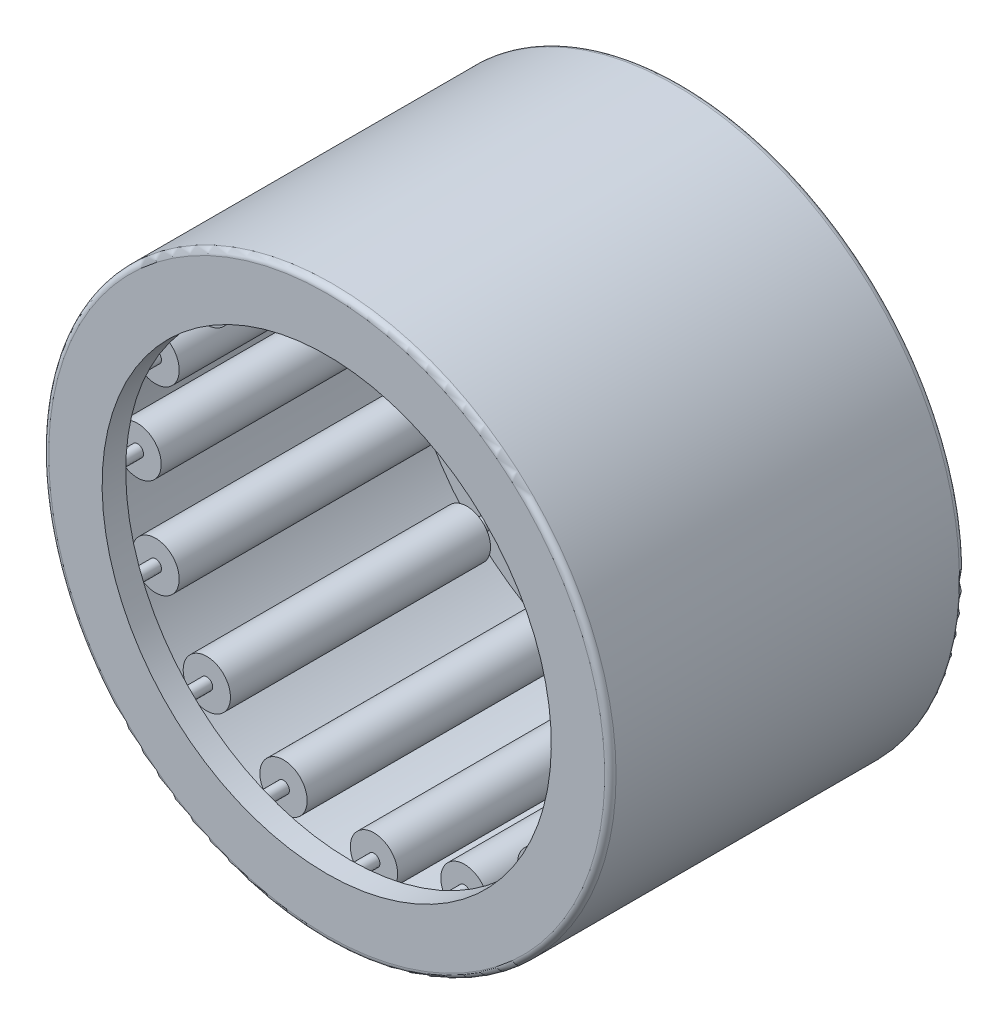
from build123d import *

# Parameters (mm, degrees)
SKETCH2_W         = 11.641666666
SKETCH2_H         = 0.79375
SKETCH3_W         = 13.758333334
SKETCH3_H         = 0.264583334
CIRPATTERN1_COUNT = 16
CIRPATTERN1_ANGLE = 337.5
FILLET1_R         = 0.254


with BuildPart() as part:
    # Sketch1 → Revolve1 (revolve)
    with BuildSketch(Plane(origin=(0, 0, 0), x_dir=(0, 0, -1), z_dir=(1, 0, 0)), mode=Mode.PRIVATE) as revolve1_sk:
        Polygon((-7.9375, 12.7), (7.9375, 12.7), (7.9375, 10.054166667), (6.879166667, 10.054166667), (6.879166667, 11.641666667), (-6.879166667, 11.641666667), (-6.879166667, 10.054166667), (-7.9375, 10.054166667), align=None)
    revolve(revolve1_sk.sketch.rotate(Axis((0, 0, 7.9375), (0, 0, -1)), 180), axis=Axis((0, 0, 7.9375), (0, 0, -1)))

    # Fillet1
    fillet1_edges = [part.edges().sort_by_distance(p)[0] for p in [
        (0, 12.7, 7.9375),
        (0, 12.7, -7.9375),
    ]]
    fillet(fillet1_edges, radius=FILLET1_R)


with BuildPart() as body_2:
    # Sketch2 → Revolve2 (revolve)
    with BuildSketch(Plane(origin=(0, 0, 0), x_dir=(0, 0, -1), z_dir=(1, 0, 0)), mode=Mode.PRIVATE) as revolve2_sk:
        with Locations((0, 11.244791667)):
            Rectangle(SKETCH2_W, SKETCH2_H)
    revolve(revolve2_sk.sketch.rotate(Axis((0, 10.583333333, 5.820833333), (0, 0, -1)), 180), axis=Axis((0, 10.583333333, 5.820833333), (0, 0, -1)))


with BuildPart() as body_3:
    # Sketch3 → Revolve3 (revolve)
    with BuildSketch(Plane(origin=(0, 0, 0), x_dir=(0, 0, -1), z_dir=(1, 0, 0)), mode=Mode.PRIVATE) as revolve3_sk:
        with Locations((0, 10.715625)):
            Rectangle(SKETCH3_W, SKETCH3_H)
    revolve(revolve3_sk.sketch.rotate(Axis((0, 10.583333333, 6.879166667), (0, 0, -1)), 90), axis=Axis((0, 10.583333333, 6.879166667), (0, 0, -1)))


with BuildPart() as cirpattern1_1:
    # CirPattern1: pattern copy
    add(body_2.part.rotate(Axis((0, 0, -7.9375), (0, 0, 1)), 1 * CIRPATTERN1_ANGLE / (CIRPATTERN1_COUNT - 1)))


with BuildPart() as cirpattern1_2:
    # CirPattern1: pattern copy
    add(body_2.part.rotate(Axis((0, 0, -7.9375), (0, 0, 1)), 2 * CIRPATTERN1_ANGLE / (CIRPATTERN1_COUNT - 1)))


with BuildPart() as cirpattern1_3:
    # CirPattern1: pattern copy
    add(body_2.part.rotate(Axis((0, 0, -7.9375), (0, 0, 1)), 3 * CIRPATTERN1_ANGLE / (CIRPATTERN1_COUNT - 1)))


with BuildPart() as cirpattern1_4:
    # CirPattern1: pattern copy
    add(body_2.part.rotate(Axis((0, 0, -7.9375), (0, 0, 1)), 4 * CIRPATTERN1_ANGLE / (CIRPATTERN1_COUNT - 1)))


with BuildPart() as cirpattern1_5:
    # CirPattern1: pattern copy
    add(body_2.part.rotate(Axis((0, 0, -7.9375), (0, 0, 1)), 5 * CIRPATTERN1_ANGLE / (CIRPATTERN1_COUNT - 1)))


with BuildPart() as cirpattern1_6:
    # CirPattern1: pattern copy
    add(body_2.part.rotate(Axis((0, 0, -7.9375), (0, 0, 1)), 6 * CIRPATTERN1_ANGLE / (CIRPATTERN1_COUNT - 1)))


with BuildPart() as cirpattern1_7:
    # CirPattern1: pattern copy
    add(body_2.part.rotate(Axis((0, 0, -7.9375), (0, 0, 1)), 7 * CIRPATTERN1_ANGLE / (CIRPATTERN1_COUNT - 1)))


with BuildPart() as cirpattern1_8:
    # CirPattern1: pattern copy
    add(body_2.part.rotate(Axis((0, 0, -7.9375), (0, 0, 1)), 8 * CIRPATTERN1_ANGLE / (CIRPATTERN1_COUNT - 1)))


with BuildPart() as cirpattern1_9:
    # CirPattern1: pattern copy
    add(body_2.part.rotate(Axis((0, 0, -7.9375), (0, 0, 1)), 9 * CIRPATTERN1_ANGLE / (CIRPATTERN1_COUNT - 1)))


with BuildPart() as cirpattern1_10:
    # CirPattern1: pattern copy
    add(body_2.part.rotate(Axis((0, 0, -7.9375), (0, 0, 1)), 10 * CIRPATTERN1_ANGLE / (CIRPATTERN1_COUNT - 1)))


with BuildPart() as cirpattern1_11:
    # CirPattern1: pattern copy
    add(body_2.part.rotate(Axis((0, 0, -7.9375), (0, 0, 1)), 11 * CIRPATTERN1_ANGLE / (CIRPATTERN1_COUNT - 1)))


with BuildPart() as cirpattern1_12:
    # CirPattern1: pattern copy
    add(body_2.part.rotate(Axis((0, 0, -7.9375), (0, 0, 1)), 12 * CIRPATTERN1_ANGLE / (CIRPATTERN1_COUNT - 1)))


with BuildPart() as cirpattern1_13:
    # CirPattern1: pattern copy
    add(body_2.part.rotate(Axis((0, 0, -7.9375), (0, 0, 1)), 13 * CIRPATTERN1_ANGLE / (CIRPATTERN1_COUNT - 1)))


with BuildPart() as cirpattern1_14:
    # CirPattern1: pattern copy
    add(body_2.part.rotate(Axis((0, 0, -7.9375), (0, 0, 1)), 14 * CIRPATTERN1_ANGLE / (CIRPATTERN1_COUNT - 1)))


with BuildPart() as cirpattern1_15:
    # CirPattern1: pattern copy
    add(body_2.part.rotate(Axis((0, 0, -7.9375), (0, 0, 1)), 15 * CIRPATTERN1_ANGLE / (CIRPATTERN1_COUNT - 1)))


with BuildPart() as cirpattern1_16:
    # CirPattern1: pattern copy
    add(body_3.part.rotate(Axis((0, 0, -7.9375), (0, 0, 1)), 1 * CIRPATTERN1_ANGLE / (CIRPATTERN1_COUNT - 1)))


with BuildPart() as cirpattern1_17:
    # CirPattern1: pattern copy
    add(body_3.part.rotate(Axis((0, 0, -7.9375), (0, 0, 1)), 2 * CIRPATTERN1_ANGLE / (CIRPATTERN1_COUNT - 1)))


with BuildPart() as cirpattern1_18:
    # CirPattern1: pattern copy
    add(body_3.part.rotate(Axis((0, 0, -7.9375), (0, 0, 1)), 3 * CIRPATTERN1_ANGLE / (CIRPATTERN1_COUNT - 1)))


with BuildPart() as cirpattern1_19:
    # CirPattern1: pattern copy
    add(body_3.part.rotate(Axis((0, 0, -7.9375), (0, 0, 1)), 4 * CIRPATTERN1_ANGLE / (CIRPATTERN1_COUNT - 1)))


with BuildPart() as cirpattern1_20:
    # CirPattern1: pattern copy
    add(body_3.part.rotate(Axis((0, 0, -7.9375), (0, 0, 1)), 5 * CIRPATTERN1_ANGLE / (CIRPATTERN1_COUNT - 1)))


with BuildPart() as cirpattern1_21:
    # CirPattern1: pattern copy
    add(body_3.part.rotate(Axis((0, 0, -7.9375), (0, 0, 1)), 6 * CIRPATTERN1_ANGLE / (CIRPATTERN1_COUNT - 1)))


with BuildPart() as cirpattern1_22:
    # CirPattern1: pattern copy
    add(body_3.part.rotate(Axis((0, 0, -7.9375), (0, 0, 1)), 7 * CIRPATTERN1_ANGLE / (CIRPATTERN1_COUNT - 1)))


with BuildPart() as cirpattern1_23:
    # CirPattern1: pattern copy
    add(body_3.part.rotate(Axis((0, 0, -7.9375), (0, 0, 1)), 8 * CIRPATTERN1_ANGLE / (CIRPATTERN1_COUNT - 1)))


with BuildPart() as cirpattern1_24:
    # CirPattern1: pattern copy
    add(body_3.part.rotate(Axis((0, 0, -7.9375), (0, 0, 1)), 9 * CIRPATTERN1_ANGLE / (CIRPATTERN1_COUNT - 1)))


with BuildPart() as cirpattern1_25:
    # CirPattern1: pattern copy
    add(body_3.part.rotate(Axis((0, 0, -7.9375), (0, 0, 1)), 10 * CIRPATTERN1_ANGLE / (CIRPATTERN1_COUNT - 1)))


with BuildPart() as cirpattern1_26:
    # CirPattern1: pattern copy
    add(body_3.part.rotate(Axis((0, 0, -7.9375), (0, 0, 1)), 11 * CIRPATTERN1_ANGLE / (CIRPATTERN1_COUNT - 1)))


with BuildPart() as cirpattern1_27:
    # CirPattern1: pattern copy
    add(body_3.part.rotate(Axis((0, 0, -7.9375), (0, 0, 1)), 12 * CIRPATTERN1_ANGLE / (CIRPATTERN1_COUNT - 1)))


with BuildPart() as cirpattern1_28:
    # CirPattern1: pattern copy
    add(body_3.part.rotate(Axis((0, 0, -7.9375), (0, 0, 1)), 13 * CIRPATTERN1_ANGLE / (CIRPATTERN1_COUNT - 1)))


with BuildPart() as cirpattern1_29:
    # CirPattern1: pattern copy
    add(body_3.part.rotate(Axis((0, 0, -7.9375), (0, 0, 1)), 14 * CIRPATTERN1_ANGLE / (CIRPATTERN1_COUNT - 1)))


with BuildPart() as cirpattern1_30:
    # CirPattern1: pattern copy
    add(body_3.part.rotate(Axis((0, 0, -7.9375), (0, 0, 1)), 15 * CIRPATTERN1_ANGLE / (CIRPATTERN1_COUNT - 1)))


solid = Compound([part.part, body_2.part, body_3.part, cirpattern1_1.part, cirpattern1_2.part, cirpattern1_3.part, cirpattern1_4.part, cirpattern1_5.part, cirpattern1_6.part, cirpattern1_7.part, cirpattern1_8.part, cirpattern1_9.part, cirpattern1_10.part, cirpattern1_11.part, cirpattern1_12.part, cirpattern1_13.part, cirpattern1_14.part, cirpattern1_15.part, cirpattern1_16.part, cirpattern1_17.part, cirpattern1_18.part, cirpattern1_19.part, cirpattern1_20.part, cirpattern1_21.part, cirpattern1_22.part, cirpattern1_23.part, cirpattern1_24.part, cirpattern1_25.part, cirpattern1_26.part, cirpattern1_27.part, cirpattern1_28.part, cirpattern1_29.part, cirpattern1_30.part])
